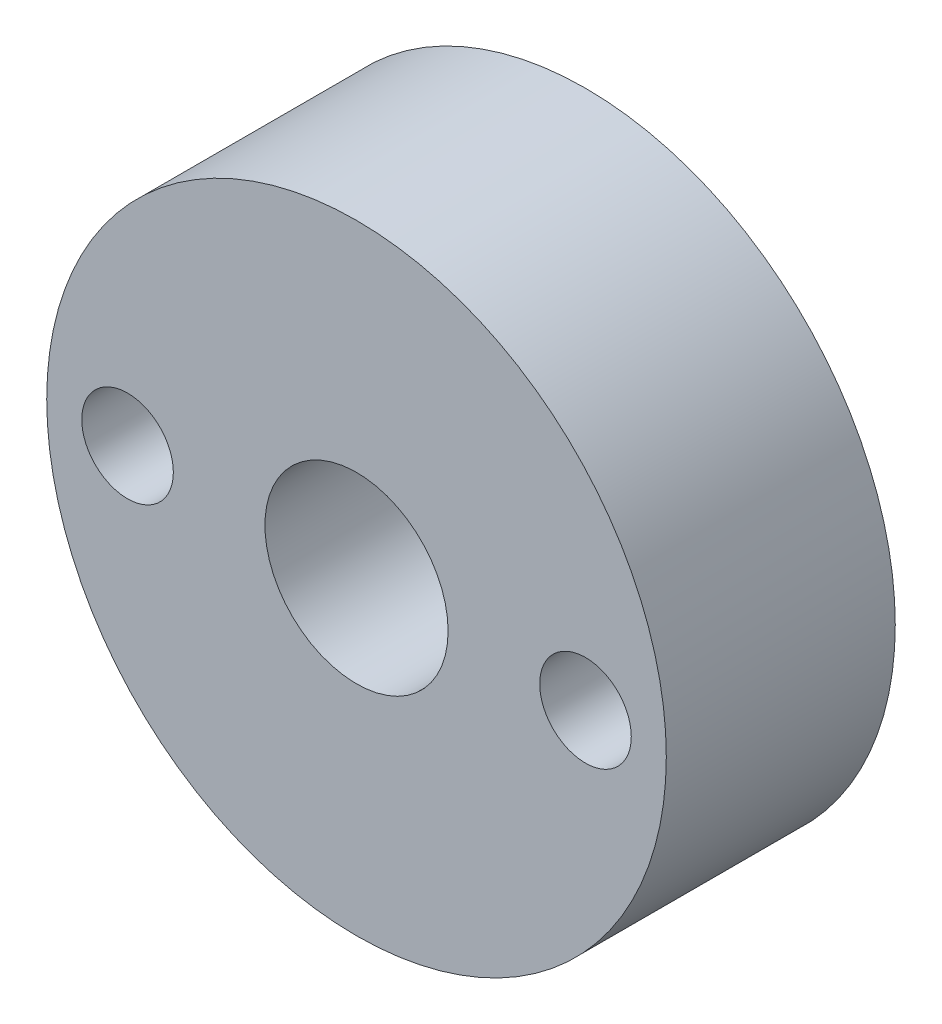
from build123d import *

# Parameters (mm, degrees)
SKETCH1_R           = 6.765
BOSS_EXTRUDE1_DEPTH = 5
SKETCH2_R           = 2
SKETCH2_R_2         = 1
CUT_EXTRUDE1_DEPTH  = 5


with BuildPart() as part:
    # Sketch1 → Boss-Extrude1 (new body)
    with BuildSketch(Plane.XY):
        Circle(SKETCH1_R)
    extrude(amount=BOSS_EXTRUDE1_DEPTH)

    # Sketch2 → Cut-Extrude1 (cut)
    with BuildSketch(Plane.XY.offset(5)):
        Circle(SKETCH2_R)
        with Locations((5, 0)):
            Circle(SKETCH2_R_2)
        with Locations((-5, 0)):
            Circle(SKETCH2_R_2)
    extrude(amount=-CUT_EXTRUDE1_DEPTH, mode=Mode.SUBTRACT)


solid = part.part
